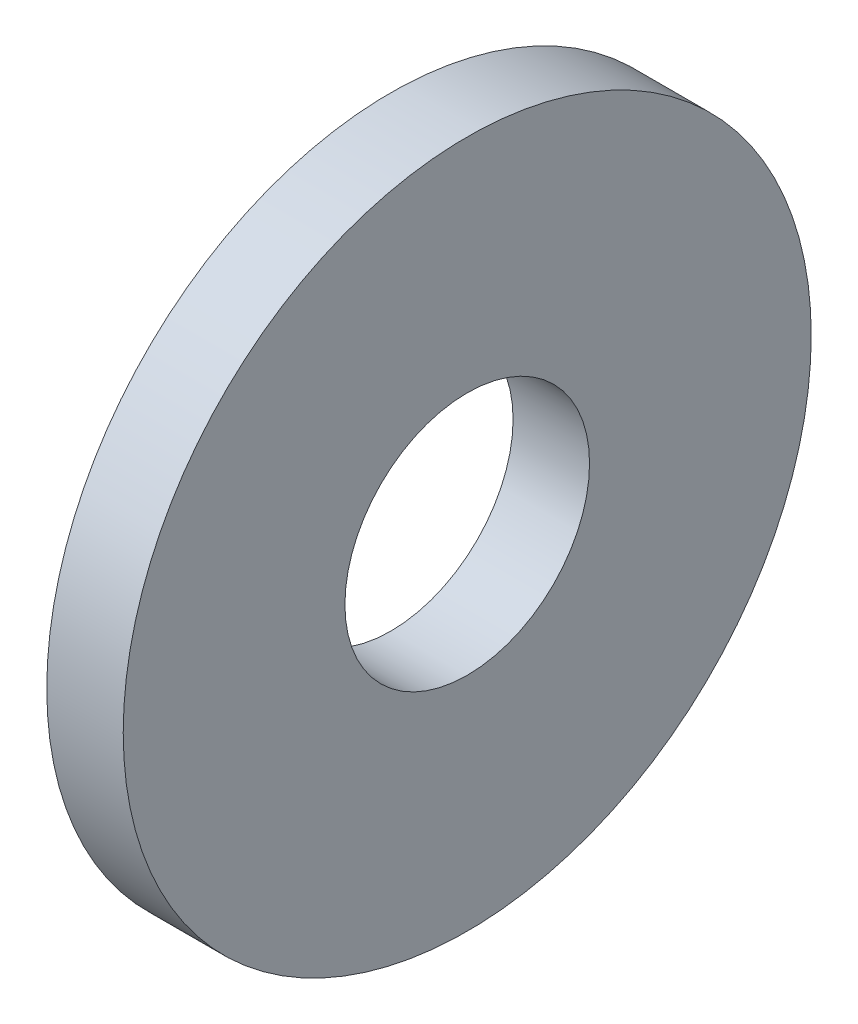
from build123d import *

# Parameters (mm, degrees)
ESQUISSE1_W = 2
ESQUISSE1_H = 5.8


with BuildPart() as part:
    # Esquisse1 → Base-R_volution (revolve)
    with BuildSketch(Plane(origin=(0, 0, 0), x_dir=(1, 0, 0), z_dir=(0, 1, 0)), mode=Mode.PRIVATE) as base_r_volution_sk:
        with Locations((1, 6.1)):
            Rectangle(ESQUISSE1_W, ESQUISSE1_H)
    revolve(base_r_volution_sk.sketch.rotate(Axis((0, 0, 0), (1, 0, 0)), 180), axis=Axis((0, 0, 0), (1, 0, 0)))


solid = part.part
